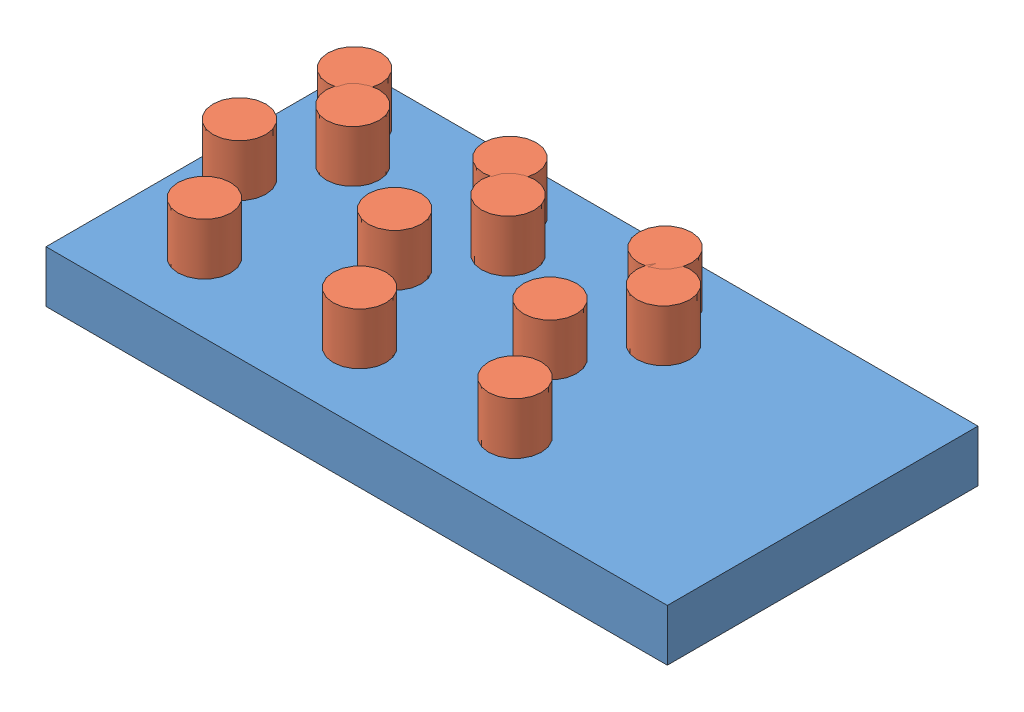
SolidWorks assembly Baugruppe1.sldasm, configuration Standard (file format 3800). Lengths in mm.
Overall size (120 20 60).
13 component instances, 2 part files, 2 mates.
Components (placement in the parent):
- Teil1-1: Teil1.SLDPRT [Standard] at origin size (120 10 60)
- Teil2-1: Teil2.SLDPRT [Standard] at (-42.8913 10 16.5317) x (1 0 0) z (0 -1 0) size (10.23 10.23 20)
- Teil2-2: Teil2.SLDPRT [Standard] at (-50.0812 10 -19.6611) x (1 0 0) z (0 -1 0) size (10.23 10.23 20)
- Teil2-3: Teil2.SLDPRT [Standard] at (-44.0694 10 -13.3128) x (1 0 0) z (0 -1 0) size (10.23 10.23 20)
- Teil2-4: Teil2.SLDPRT [Standard] at (-52.646 10 0) x (1 0 0) z (0 -1 0) size (10.23 10.23 20)
- Teil2-5: Teil2.SLDPRT [Standard] at (-12.8913 10 16.5317) x (1 0 0) z (0 -1 0) size (10.23 10.23 20)
- Teil2-6: Teil2.SLDPRT [Standard] at (17.1087 10 16.5317) x (1 0 0) z (0 -1 0) size (10.23 10.23 20)
- Teil2-7: Teil2.SLDPRT [Standard] at (-20.0812 10 -19.6611) x (1 0 0) z (0 -1 0) size (10.23 10.23 20)
- Teil2-8: Teil2.SLDPRT [Standard] at (9.9188 10 -19.6611) x (1 0 0) z (0 -1 0) size (10.23 10.23 20)
- Teil2-9: Teil2.SLDPRT [Standard] at (-14.0694 10 -13.3128) x (1 0 0) z (0 -1 0) size (10.23 10.23 20)
- Teil2-10: Teil2.SLDPRT [Standard] at (15.9306 10 -13.3128) x (1 0 0) z (0 -1 0) size (10.23 10.23 20)
- Teil2-11: Teil2.SLDPRT [Standard] at (-22.646 10 0) x (1 0 0) z (0 -1 0) size (10.23 10.23 20)
- Teil2-12: Teil2.SLDPRT [Standard] at (7.354 10 0) x (1 0 0) z (0 -1 0) size (10.23 10.23 20)
Mates (geometry in assembly coordinates):
- Konzentrisch2: concentric aligned: cylinder of Teil2-1; cylinder of Teil1-1
- Deckungsgleich1: coincident anti-aligned: plane of Teil1-1 through (60 10 30) normal (0 1 0); unknown of Teil2-1
